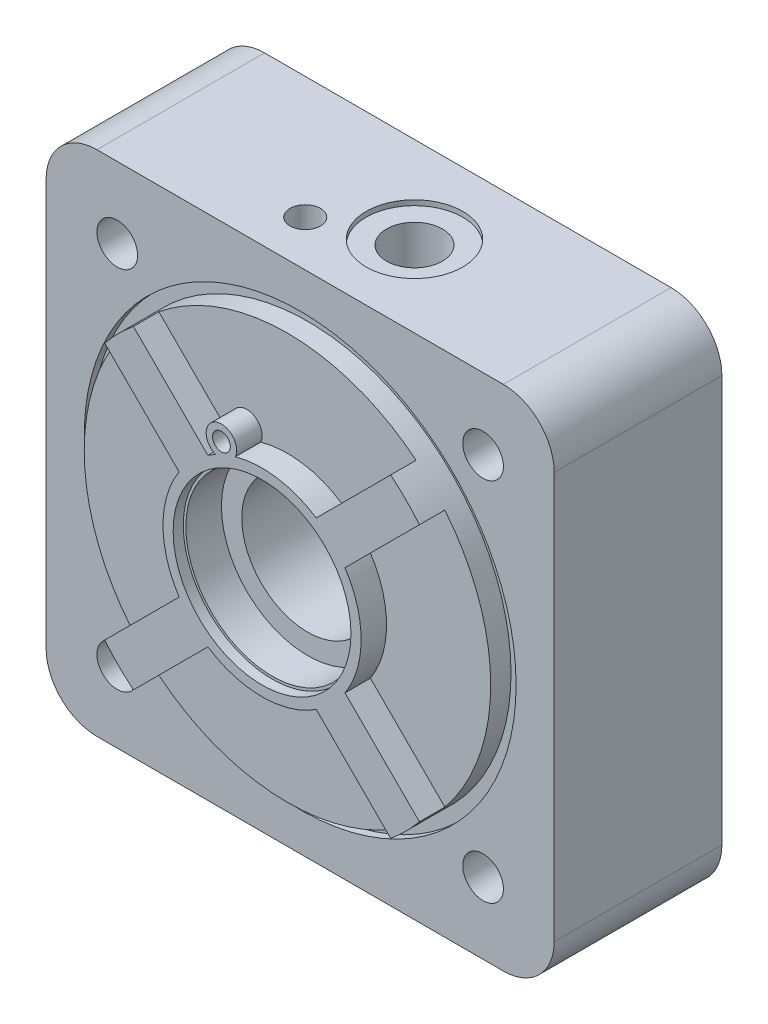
from build123d import *
from build123d.topology import SkipClean

# Parameters (mm, degrees)
BASE_EXTRUSION_DEPTH      = 1
BASE_EXTRUSION_DEPTH_BACK = 32
ESQUISSE2_R               = 20
BOSS_EXTRU_1_DEPTH        = 4
ESQUISSE3_R               = 6.5
ENL_V_MAT_EXTRU_1_DEPTH   = 31
ESQUISSE4_R               = 4
ENL_V_MAT_EXTRU_2_DEPTH   = 81.654238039
ESQUISSE7_R               = 42.5
ENL_V_MAT_EXTRU_3_DEPTH   = 1.5
ESQUISSE8_R               = 40
BOSS_EXTRU_2_DEPTH        = 4
ESQUISSE9_R               = 17
BOSS_EXTRU_3_DEPTH        = 5
ESQUISSE10_R              = 13
ENL_V_MAT_EXTRU_4_DEPTH   = 29
ENL_V_START               = -6
ESQUISSE12_R              = 20
ENL_V_MAT_EXTRU_7_DEPTH   = 6
ESQUISSE16_R              = 9.5
ENL_V_MAT_EXTRU_8_DEPTH   = 1
ESQUISSE17_R              = 5.5
ENL_V_MAT_EXTRU_9_DEPTH   = 35
ESQUISSE18_R              = 3
ENL_V_MAT_EXTRU_10_DEPTH  = 7
ESQUISSE19_R              = 1.75
ENL_V_MAT_EXTRU_11_DEPTH  = 7
ESQUISSE21_R              = 1.75
ENL_V_MAT_EXTRU_13_DEPTH  = 20
ESQUISSE20_R              = 0.75
ENL_V_MAT_EXTRU_12_DEPTH  = 15
ESQUISSE22_R              = 17.5
ENL_V_MAT_EXTRU_14_DEPTH  = 2
ENL_V_START_2             = -4
ESQUISSE23_R              = 17
ENL_V_MAT_EXTRU_15_DEPTH  = 4


with BuildPart() as part:
    # Esquisse1 → Base-Extrusion (new, two sides: drawn at the far end of the back side and taken through both)
    with BuildSketch(Plane.XY.offset(-BASE_EXTRUSION_DEPTH_BACK)):
        with BuildLine():
            Line((-50, 40), (-50, -40))
            ThreePointArc((-50, -40), (-47.071067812, -47.071067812), (-40, -50))
            Line((-40, -50), (40, -50))
            ThreePointArc((40, -50), (47.071067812, -47.071067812), (50, -40))
            Line((50, -40), (50, 40))
            ThreePointArc((50, 40), (47.071067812, 47.071067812), (40, 50))
            Line((40, 50), (-40, 50))
            ThreePointArc((-40, 50), (-47.071067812, 47.071067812), (-50, 40))
        make_face()
    extrude(amount=BASE_EXTRUSION_DEPTH + BASE_EXTRUSION_DEPTH_BACK)

    # Esquisse2 → Boss.-Extru.1 (add)
    with BuildSketch(Plane(origin=(0, 0, -32), x_dir=(-1, 0, 0), z_dir=(0, 0, -1))):
        Circle(ESQUISSE2_R)
    extrude(amount=BOSS_EXTRU_1_DEPTH)

    # Esquisse3 → Enl_v. mat.-Extru.1 (cut)
    with BuildSketch(Plane(origin=(-0.323821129, 5.504958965, -36), x_dir=(-1, 0, 0), z_dir=(0, 0, -1))):
        with Locations((35.676178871, 30.495041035)):
            Circle(ESQUISSE3_R)
        with Locations((-36.323821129, 30.495041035)):
            Circle(ESQUISSE3_R)
        with Locations((-36.323821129, -41.504958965)):
            Circle(ESQUISSE3_R)
        with Locations((35.676178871, -41.504958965)):
            Circle(ESQUISSE3_R)
    extrude(amount=-ENL_V_MAT_EXTRU_1_DEPTH, mode=Mode.SUBTRACT)

    # Esquisse4 → Enl_v. mat.-Extru.2 (cut, through all)
    with BuildSketch(Plane(origin=(-0.675961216, -0.675961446, -36), x_dir=(-1, 0, 0), z_dir=(0, 0, -1))):
        with Locations((35.324038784, 36.675961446)):
            Circle(ESQUISSE4_R)
        with Locations((-36.675961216, 36.675961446)):
            Circle(ESQUISSE4_R)
        with Locations((-36.675961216, -35.324038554)):
            Circle(ESQUISSE4_R)
        with Locations((35.324038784, -35.324038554)):
            Circle(ESQUISSE4_R)
    extrude(amount=-ENL_V_MAT_EXTRU_2_DEPTH, mode=Mode.SUBTRACT)

    # Esquisse7 → Enl_v. mat.-Extru.3 (cut)
    with BuildSketch(Plane.XY.offset(1)):
        Circle(ESQUISSE7_R)
    extrude(amount=-ENL_V_MAT_EXTRU_3_DEPTH, mode=Mode.SUBTRACT)

    # Esquisse8 → Boss.-Extru.2 (add)
    with BuildSketch(Plane.XY.offset(-0.5)):
        with Locations(Location((0, 0, 0), (0, 0, 140.739170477))):
            Circle(ESQUISSE8_R)
    extrude(amount=BOSS_EXTRU_2_DEPTH)

    # Esquisse9 → Boss.-Extru.3 (add)
    with SkipClean():  # the faces are left unmerged after this step: merging them gives an invalid solid
        with BuildSketch(Plane.XY.offset(3.5)):
            with BuildLine():
                Line((-10.666942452, -16.323796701), (-25.314067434, -30.970921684))
                ThreePointArc((-25.314067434, -30.970921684), (-28.284271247, -28.284271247), (-30.970921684, -25.314067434))
                Line((-30.970921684, -25.314067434), (-16.323796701, -10.666942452))
                ThreePointArc((-16.323796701, -10.666942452), (-19.5, 0), (-16.323796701, 10.666942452))
                Line((-16.323796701, 10.666942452), (-30.970921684, 25.314067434))
                ThreePointArc((-30.970921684, 25.314067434), (-28.284271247, 28.284271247), (-25.314067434, 30.970921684))
                Line((-25.314067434, 30.970921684), (-10.666942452, 16.323796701))
                ThreePointArc((-10.666942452, 16.323796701), (-9.913849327, 16.791831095), (-9.140258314, 17.225146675))
                ThreePointArc((-9.140258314, 17.225146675), (-9.114172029, 22.785430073), (-5.260603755, 18.777008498))
                ThreePointArc((-5.260603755, 18.777008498), (-2.655026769, 19.318406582), (0, 19.5))
                ThreePointArc((0, 19.5), (5.564888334, 18.689088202), (10.666942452, 16.323796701))
                Line((10.666942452, 16.323796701), (25.314067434, 30.970921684))
                ThreePointArc((25.314067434, 30.970921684), (28.284271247, 28.284271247), (30.970921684, 25.314067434))
                Line((30.970921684, 25.314067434), (16.323796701, 10.666942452))
                ThreePointArc((16.323796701, 10.666942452), (19.5, 0), (16.323796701, -10.666942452))
                Line((16.323796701, -10.666942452), (30.970921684, -25.314067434))
                ThreePointArc((30.970921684, -25.314067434), (28.284271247, -28.284271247), (25.314067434, -30.970921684))
                Line((25.314067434, -30.970921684), (10.666942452, -16.323796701))
                ThreePointArc((10.666942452, -16.323796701), (0, -19.5), (-10.666942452, -16.323796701))
            make_face()
            Circle(ESQUISSE9_R, mode=Mode.SUBTRACT)
        extrude(amount=BOSS_EXTRU_3_DEPTH)

    # Esquisse10 → Enl_v. mat.-Extru.4 (cut)
    with SkipClean():  # the faces are left unmerged after this step: merging them gives an invalid solid
        with BuildSketch(Plane.XY.offset(3.5)):
            Circle(ESQUISSE10_R)
        extrude(amount=-ENL_V_MAT_EXTRU_4_DEPTH, mode=Mode.SUBTRACT)

    # Esquisse12 → Enl_v. mat.-Extru.7 (cut)
    with SkipClean():  # the faces are left unmerged after this step: merging them gives an invalid solid
        with BuildSketch(Plane(origin=(-0.135192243, -0.135192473, -36), x_dir=(-1, 0, 0), z_dir=(0, 0, -1)).offset(ENL_V_START)):
            with BuildLine():
                Line((24.864807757, 32.135192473), (24.864807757, 38.135192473))
                ThreePointArc((24.864807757, 38.135192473), (24.279021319, 39.549406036), (22.864807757, 40.135192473))
                Line((22.864807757, 40.135192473), (-23.135192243, 40.135192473))
                ThreePointArc((-23.135192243, 40.135192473), (-24.549405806, 39.549406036), (-25.135192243, 38.135192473))
                Line((-25.135192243, 38.135192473), (-25.135192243, 32.135192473))
                ThreePointArc((-25.135192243, 32.135192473), (-27.185444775, 27.185445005), (-32.135192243, 25.135192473))
                Line((-32.135192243, 25.135192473), (-38.135192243, 25.135192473))
                ThreePointArc((-38.135192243, 25.135192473), (-39.549405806, 24.549406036), (-40.135192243, 23.135192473))
                Line((-40.135192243, 23.135192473), (-40.135192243, -22.864807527))
                ThreePointArc((-40.135192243, -22.864807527), (-39.549405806, -24.279021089), (-38.135192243, -24.864807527))
                Line((-38.135192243, -24.864807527), (-32.135192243, -24.864807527))
                ThreePointArc((-32.135192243, -24.864807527), (-27.185444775, -26.915060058), (-25.135192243, -31.864807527))
                Line((-25.135192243, -31.864807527), (-25.135192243, -37.864807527))
                ThreePointArc((-25.135192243, -37.864807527), (-24.549405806, -39.279021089), (-23.135192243, -39.864807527))
                Line((-23.135192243, -39.864807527), (22.864807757, -39.864807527))
                ThreePointArc((22.864807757, -39.864807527), (24.279021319, -39.279021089), (24.864807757, -37.864807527))
                Line((24.864807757, -37.864807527), (24.864807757, -31.864807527))
                ThreePointArc((24.864807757, -31.864807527), (26.915060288, -26.915060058), (31.864807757, -24.864807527))
                Line((31.864807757, -24.864807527), (37.864807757, -24.864807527))
                ThreePointArc((37.864807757, -24.864807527), (39.279021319, -24.279021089), (39.864807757, -22.864807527))
                Line((39.864807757, -22.864807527), (39.864807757, 23.135192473))
                ThreePointArc((39.864807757, 23.135192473), (39.279021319, 24.549406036), (37.864807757, 25.135192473))
                Line((37.864807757, 25.135192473), (31.864807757, 25.135192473))
                ThreePointArc((31.864807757, 25.135192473), (26.915060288, 27.185445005), (24.864807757, 32.135192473))
            make_face()
            with Locations((-0.135192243, 0.135192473)):
                Circle(ESQUISSE12_R, mode=Mode.SUBTRACT)
        extrude(amount=ENL_V_MAT_EXTRU_7_DEPTH, mode=Mode.SUBTRACT)

    # Esquisse16 → Enl_v. mat.-Extru.8 (cut)
    with SkipClean():  # the faces are left unmerged after this step: merging them gives an invalid solid
        with BuildSketch(Plane(origin=(0, 50, 0), x_dir=(-1, 0, 0), z_dir=(0, 1, 0))):
            with Locations(Location((-6.5, -15, 0), (0, 0, 90))):
                Circle(ESQUISSE16_R)
        extrude(amount=-ENL_V_MAT_EXTRU_8_DEPTH, mode=Mode.SUBTRACT)

    # Esquisse17 → Enl_v. mat.-Extru.9 (cut)
    with SkipClean():  # the faces are left unmerged after this step: merging them gives an invalid solid
        with BuildSketch(Plane(origin=(0, 49, 0), x_dir=(-1, 0, 0), z_dir=(0, 1, 0))):
            with Locations(Location((-6.5, -15, 0), (0, 0, 90))):
                Circle(ESQUISSE17_R)
        extrude(amount=-ENL_V_MAT_EXTRU_9_DEPTH, mode=Mode.SUBTRACT)

    # Esquisse18 → Enl_v. mat.-Extru.10 (cut)
    with SkipClean():  # the faces are left unmerged after this step: merging them gives an invalid solid
        with BuildSketch(Plane(origin=(0, 50, 0), x_dir=(-1, 0, 0), z_dir=(0, 1, 0))):
            with Locations(Location((8, -8, 0), (0, 0, 90))):
                Circle(ESQUISSE18_R)
        extrude(amount=-ENL_V_MAT_EXTRU_10_DEPTH, mode=Mode.SUBTRACT)

    # Esquisse19 → Enl_v. mat.-Extru.11 (cut)
    with SkipClean():  # the faces are left unmerged after this step: merging them gives an invalid solid
        with BuildSketch(Plane(origin=(0, 43, 0), x_dir=(-1, 0, 0), z_dir=(0, 1, 0))):
            with Locations(Location((8, -8, 0), (0, 0, 90))):
                Circle(ESQUISSE19_R)
        extrude(amount=-ENL_V_MAT_EXTRU_11_DEPTH, mode=Mode.SUBTRACT)

    # Esquisse21 → Enl_v. mat.-Extru.13 (cut)
    with SkipClean():  # the faces are left unmerged after this step: merging them gives an invalid solid
        with BuildSketch(Plane.XY.offset(8.5)):
            with Locations((-8, 20)):
                Circle(ESQUISSE21_R)
        extrude(amount=-ENL_V_MAT_EXTRU_13_DEPTH, mode=Mode.SUBTRACT)

    # Esquisse20 → Enl_v. mat.-Extru.12 (cut)
    with SkipClean():  # the faces are left unmerged after this step: merging them gives an invalid solid
        with BuildSketch(Plane(origin=(0, 36, 0), x_dir=(-1, 0, 0), z_dir=(0, 1, 0))):
            with Locations(Location((8, -8, 0), (0, 0, 90))):
                Circle(ESQUISSE20_R)
        extrude(amount=-ENL_V_MAT_EXTRU_12_DEPTH, mode=Mode.SUBTRACT)

    # Esquisse22 → Enl_v. mat.-Extru.14 (cut)
    with SkipClean():  # the faces are left unmerged after this step: merging them gives an invalid solid
        with BuildSketch(Plane.XY.offset(8.5)):
            Circle(ESQUISSE22_R)
        extrude(amount=-ENL_V_MAT_EXTRU_14_DEPTH, mode=Mode.SUBTRACT)

    # Esquisse23 → Enl_v. mat.-Extru.15 (cut)
    with SkipClean():  # the faces are left unmerged after this step: merging them gives an invalid solid
        with BuildSketch(Plane.XY.offset(3.5).offset(ENL_V_START_2)):
            Circle(ESQUISSE23_R)
        extrude(amount=ENL_V_MAT_EXTRU_15_DEPTH, mode=Mode.SUBTRACT)


solid = part.part
